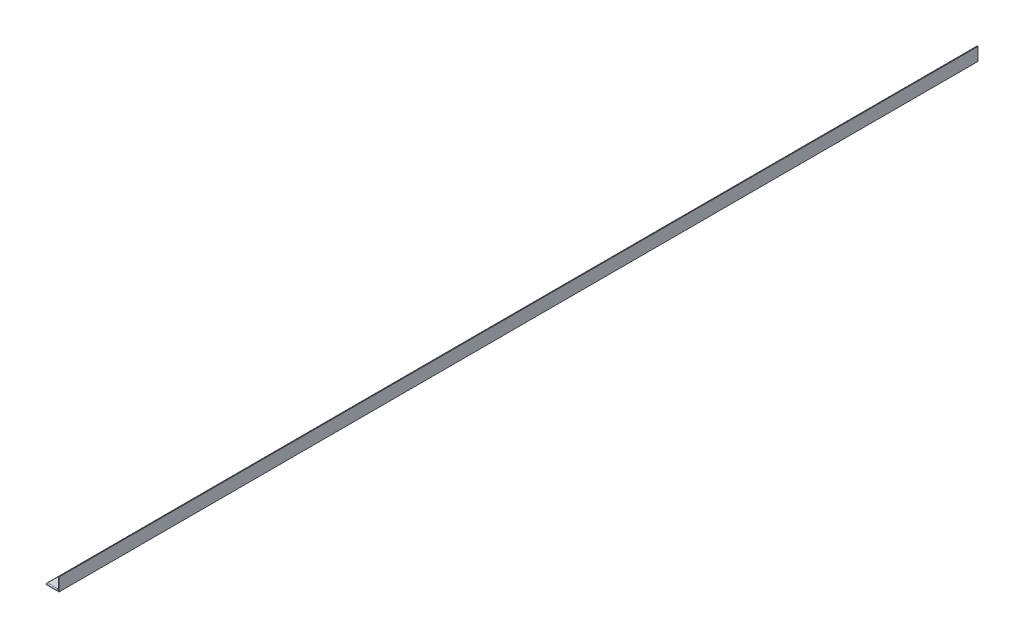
from build123d import *

# Parameters (mm, degrees)
BOSS_EXTRU_1_DEPTH = 2110
CONG_1_R           = 2


with BuildPart() as part:
    # Esquisse1 → Boss.-Extru.1 (new body)
    with BuildSketch(Plane.XY):
        Polygon((0, 0), (-30, 0), (-30, 3), (-3, 3), (-3, 30), (0, 30), align=None)
    extrude(amount=BOSS_EXTRU_1_DEPTH)

    # Cong_1
    cong_1_edges = [part.edges().sort_by_distance(p)[0] for p in [
        (-3, 16.5, 2110),
        (-30, 3, 1055),
        (-3, 3, 1055),
        (-3, 30, 1055),
        (-16.5, 3, 2110),
        (-16.5, 3, 0),
        (-3, 16.5, 0),
    ]]
    fillet(cong_1_edges, radius=CONG_1_R)


solid = part.part
